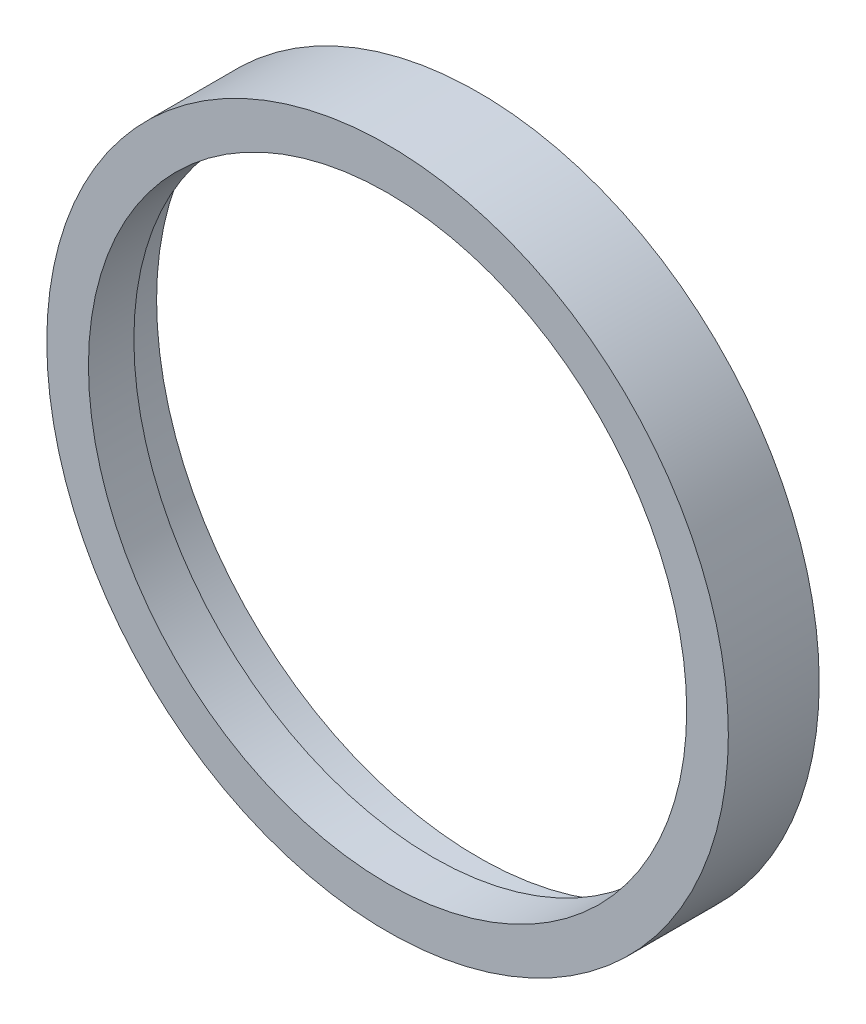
from build123d import *

# Parameters (mm, degrees)
SKETCH1_R           = 28.575
SKETCH1_R_2         = 25.0825
BOSS_EXTRUDE1_DEPTH = 7.62
SKETCH2_R           = 26.9875
CUT_EXTRUDE1_DEPTH  = 3.81


with BuildPart() as part:
    # Sketch1 → Boss-Extrude1 (new body)
    with BuildSketch(Plane.XY):
        with Locations(Location((0, 0, 0), (0, 0, 180))):
            Circle(SKETCH1_R)
        with Locations(Location((0, 0, 0), (0, 0, 180))):
            Circle(SKETCH1_R_2, mode=Mode.SUBTRACT)
    extrude(amount=BOSS_EXTRUDE1_DEPTH)

    # Sketch2 → Cut-Extrude1 (cut)
    with BuildSketch(Plane.XY):
        with Locations(Location((0, 0, 0), (0, 0, 180))):
            Circle(SKETCH2_R)
    extrude(amount=CUT_EXTRUDE1_DEPTH, mode=Mode.SUBTRACT)


solid = part.part
